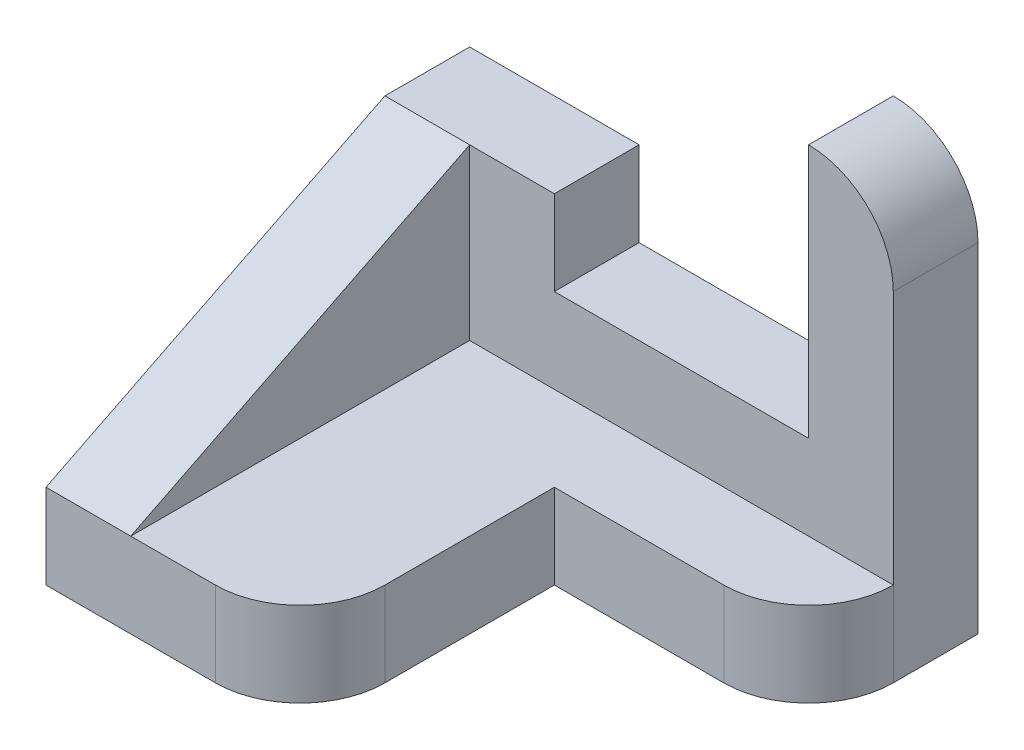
ISO-10303-21;
HEADER;
FILE_DESCRIPTION(('STEP AP214'),'2;1');
FILE_NAME('part.step','',(''),(''),'','','');
FILE_SCHEMA(('AUTOMOTIVE_DESIGN { 1 0 10303 214 1 1 1 1 }'));
ENDSEC;
DATA;
#1=APPLICATION_CONTEXT('core data for automotive mechanical design processes');
#2=APPLICATION_PROTOCOL_DEFINITION('international standard','automotive_design',2000,#1);
#3=PRODUCT_CONTEXT('',#1,'mechanical');
#4=PRODUCT('Part','Part','',(#3));
#5=PRODUCT_RELATED_PRODUCT_CATEGORY('part','',(#4));
#6=PRODUCT_DEFINITION_FORMATION('','',#4);
#7=PRODUCT_DEFINITION_CONTEXT('part definition',#1,'design');
#8=PRODUCT_DEFINITION('design','',#6,#7);
#9=PRODUCT_DEFINITION_SHAPE('','',#8);
#10=(LENGTH_UNIT() NAMED_UNIT(*) SI_UNIT(.MILLI.,.METRE.));
#11=(NAMED_UNIT(*) PLANE_ANGLE_UNIT() SI_UNIT($,.RADIAN.));
#12=(NAMED_UNIT(*) SI_UNIT($,.STERADIAN.) SOLID_ANGLE_UNIT());
#13=UNCERTAINTY_MEASURE_WITH_UNIT(LENGTH_MEASURE(1.E-05),#10,'distance_accuracy_value','');
#14=(GEOMETRIC_REPRESENTATION_CONTEXT(3) GLOBAL_UNCERTAINTY_ASSIGNED_CONTEXT((#13)) GLOBAL_UNIT_ASSIGNED_CONTEXT((#10,
#11,#12)) REPRESENTATION_CONTEXT('',''));
#15=CARTESIAN_POINT('',(0.,0.,0.));
#16=DIRECTION('',(0.,0.,1.));
#17=DIRECTION('',(1.,0.,0.));
#18=AXIS2_PLACEMENT_3D('',#15,#16,#17);
#19=CARTESIAN_POINT('',(0.,10.,0.));
#20=DIRECTION('',(0.,-1.,0.));
#21=DIRECTION('',(0.,0.,-1.));
#22=AXIS2_PLACEMENT_3D('',#19,#20,#21);
#23=PLANE('',#22);
#24=DIRECTION('',(1.,0.,0.));
#25=VECTOR('',#24,1.);
#26=CARTESIAN_POINT('',(60.,10.,20.));
#27=LINE('',#26,#25);
#28=CARTESIAN_POINT('',(30.,10.,20.));
#29=VERTEX_POINT('',#28);
#30=CARTESIAN_POINT('',(50.,10.,20.));
#31=VERTEX_POINT('',#30);
#32=EDGE_CURVE('E205',#29,#31,#27,.T.);
#33=ORIENTED_EDGE('',*,*,#32,.T.);
#34=CARTESIAN_POINT('',(50.,10.,10.));
#35=DIRECTION('',(0.,-1.,0.));
#36=DIRECTION('',(0.,0.,-1.));
#37=AXIS2_PLACEMENT_3D('',#34,#35,#36);
#38=CIRCLE('',#37,10.);
#39=CARTESIAN_POINT('',(60.,10.,10.));
#40=VERTEX_POINT('',#39);
#41=EDGE_CURVE('E262',#31,#40,#38,.F.);
#42=ORIENTED_EDGE('',*,*,#41,.T.);
#43=DIRECTION('',(-1.,0.,0.));
#44=VECTOR('',#43,1.);
#45=CARTESIAN_POINT('',(30.,10.,10.));
#46=LINE('',#45,#44);
#47=CARTESIAN_POINT('',(10.,10.,10.));
#48=VERTEX_POINT('',#47);
#49=EDGE_CURVE('E190',#40,#48,#46,.T.);
#50=ORIENTED_EDGE('',*,*,#49,.T.);
#51=DIRECTION('',(0.,0.,-1.));
#52=VECTOR('',#51,1.);
#53=CARTESIAN_POINT('',(10.,10.,0.));
#54=LINE('',#53,#52);
#55=CARTESIAN_POINT('',(10.,10.,50.));
#56=VERTEX_POINT('',#55);
#57=EDGE_CURVE('E142',#56,#48,#54,.T.);
#58=ORIENTED_EDGE('',*,*,#57,.F.);
#59=DIRECTION('',(1.,0.,0.));
#60=VECTOR('',#59,1.);
#61=CARTESIAN_POINT('',(30.,10.,50.));
#62=LINE('',#61,#60);
#63=CARTESIAN_POINT('',(20.,10.,50.));
#64=VERTEX_POINT('',#63);
#65=EDGE_CURVE('E203',#56,#64,#62,.T.);
#66=ORIENTED_EDGE('',*,*,#65,.T.);
#67=CARTESIAN_POINT('',(20.,10.,40.));
#68=DIRECTION('',(0.,-1.,0.));
#69=DIRECTION('',(0.,0.,-1.));
#70=AXIS2_PLACEMENT_3D('',#67,#68,#69);
#71=CIRCLE('',#70,10.);
#72=CARTESIAN_POINT('',(30.,10.,40.));
#73=VERTEX_POINT('',#72);
#74=EDGE_CURVE('E47',#64,#73,#71,.F.);
#75=ORIENTED_EDGE('',*,*,#74,.T.);
#76=DIRECTION('',(0.,0.,-1.));
#77=VECTOR('',#76,1.);
#78=CARTESIAN_POINT('',(30.,10.,20.));
#79=LINE('',#78,#77);
#80=EDGE_CURVE('E202',#73,#29,#79,.T.);
#81=ORIENTED_EDGE('',*,*,#80,.T.);
#82=EDGE_LOOP('',(#33,#42,#50,#58,#66,#75,#81));
#83=FACE_BOUND('',#82,.T.);
#84=ADVANCED_FACE('F32',(#83),#23,.F.);
#85=CARTESIAN_POINT('',(30.,-26.2306360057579,10.));
#86=DIRECTION('',(0.,0.,1.));
#87=DIRECTION('',(1.,0.,0.));
#88=AXIS2_PLACEMENT_3D('',#85,#86,#87);
#89=PLANE('',#88);
#90=DIRECTION('',(0.,-1.,0.));
#91=VECTOR('',#90,1.);
#92=CARTESIAN_POINT('',(60.,-26.2306360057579,10.));
#93=LINE('',#92,#91);
#94=CARTESIAN_POINT('',(60.,40.,10.));
#95=VERTEX_POINT('',#94);
#96=EDGE_CURVE('E234',#95,#40,#93,.T.);
#97=ORIENTED_EDGE('',*,*,#96,.F.);
#98=CARTESIAN_POINT('',(50.,40.,10.));
#99=DIRECTION('',(0.,0.,1.));
#100=DIRECTION('',(1.,0.,0.));
#101=AXIS2_PLACEMENT_3D('',#98,#99,#100);
#102=CIRCLE('',#101,10.);
#103=CARTESIAN_POINT('',(50.,50.,10.));
#104=VERTEX_POINT('',#103);
#105=EDGE_CURVE('E11',#95,#104,#102,.T.);
#106=ORIENTED_EDGE('',*,*,#105,.T.);
#107=DIRECTION('',(0.,1.,0.));
#108=VECTOR('',#107,1.);
#109=CARTESIAN_POINT('',(50.,-26.2306360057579,10.));
#110=LINE('',#109,#108);
#111=CARTESIAN_POINT('',(50.,20.,10.));
#112=VERTEX_POINT('',#111);
#113=EDGE_CURVE('E239',#112,#104,#110,.T.);
#114=ORIENTED_EDGE('',*,*,#113,.F.);
#115=DIRECTION('',(1.,0.,0.));
#116=VECTOR('',#115,1.);
#117=CARTESIAN_POINT('',(30.,20.,10.));
#118=LINE('',#117,#116);
#119=CARTESIAN_POINT('',(20.,20.,10.));
#120=VERTEX_POINT('',#119);
#121=EDGE_CURVE('E241',#120,#112,#118,.T.);
#122=ORIENTED_EDGE('',*,*,#121,.F.);
#123=DIRECTION('',(0.,-1.,0.));
#124=VECTOR('',#123,1.);
#125=CARTESIAN_POINT('',(20.,-26.2306360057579,10.));
#126=LINE('',#125,#124);
#127=CARTESIAN_POINT('',(20.,30.,10.));
#128=VERTEX_POINT('',#127);
#129=EDGE_CURVE('E165',#128,#120,#126,.T.);
#130=ORIENTED_EDGE('',*,*,#129,.F.);
#131=DIRECTION('',(1.,0.,0.));
#132=VECTOR('',#131,1.);
#133=CARTESIAN_POINT('',(30.,30.,10.));
#134=LINE('',#133,#132);
#135=CARTESIAN_POINT('',(10.,30.,10.));
#136=VERTEX_POINT('',#135);
#137=EDGE_CURVE('E160',#136,#128,#134,.T.);
#138=ORIENTED_EDGE('',*,*,#137,.F.);
#139=DIRECTION('',(0.,-1.,0.));
#140=VECTOR('',#139,1.);
#141=CARTESIAN_POINT('',(10.,-26.2306360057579,10.));
#142=LINE('',#141,#140);
#143=EDGE_CURVE('E137',#136,#48,#142,.T.);
#144=ORIENTED_EDGE('',*,*,#143,.T.);
#145=ORIENTED_EDGE('',*,*,#49,.F.);
#146=EDGE_LOOP('',(#97,#106,#114,#122,#130,#138,#144,#145));
#147=FACE_BOUND('',#146,.T.);
#148=ADVANCED_FACE('F162',(#147),#89,.T.);
#149=CARTESIAN_POINT('',(0.,10.,50.));
#150=DIRECTION('',(1.,0.,0.));
#151=DIRECTION('',(0.,0.,-1.));
#152=AXIS2_PLACEMENT_3D('',#149,#150,#151);
#153=PLANE('',#152);
#154=DIRECTION('',(0.,-1.,0.));
#155=VECTOR('',#154,1.);
#156=CARTESIAN_POINT('',(0.,10.,50.));
#157=LINE('',#156,#155);
#158=CARTESIAN_POINT('',(0.,10.,50.));
#159=VERTEX_POINT('',#158);
#160=CARTESIAN_POINT('',(0.,0.,50.));
#161=VERTEX_POINT('',#160);
#162=EDGE_CURVE('E148',#159,#161,#157,.T.);
#163=ORIENTED_EDGE('',*,*,#162,.F.);
#164=DIRECTION('',(0.,-0.447213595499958,0.894427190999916));
#165=VECTOR('',#164,1.);
#166=CARTESIAN_POINT('',(0.,30.,10.));
#167=LINE('',#166,#165);
#168=CARTESIAN_POINT('',(0.,30.,10.));
#169=VERTEX_POINT('',#168);
#170=EDGE_CURVE('E157',#169,#159,#167,.T.);
#171=ORIENTED_EDGE('',*,*,#170,.F.);
#172=DIRECTION('',(0.,0.,-1.));
#173=VECTOR('',#172,1.);
#174=CARTESIAN_POINT('',(0.,30.,10.));
#175=LINE('',#174,#173);
#176=CARTESIAN_POINT('',(0.,30.,0.));
#177=VERTEX_POINT('',#176);
#178=EDGE_CURVE('E174',#169,#177,#175,.T.);
#179=ORIENTED_EDGE('',*,*,#178,.T.);
#180=DIRECTION('',(0.,-1.,0.));
#181=VECTOR('',#180,1.);
#182=CARTESIAN_POINT('',(0.,10.,0.));
#183=LINE('',#182,#181);
#184=CARTESIAN_POINT('',(0.,0.,0.));
#185=VERTEX_POINT('',#184);
#186=EDGE_CURVE('E208',#177,#185,#183,.T.);
#187=ORIENTED_EDGE('',*,*,#186,.T.);
#188=DIRECTION('',(0.,0.,1.));
#189=VECTOR('',#188,1.);
#190=CARTESIAN_POINT('',(0.,0.,50.));
#191=LINE('',#190,#189);
#192=EDGE_CURVE('E200',#185,#161,#191,.T.);
#193=ORIENTED_EDGE('',*,*,#192,.T.);
#194=EDGE_LOOP('',(#163,#171,#179,#187,#193));
#195=FACE_BOUND('',#194,.T.);
#196=ADVANCED_FACE('F254',(#195),#153,.F.);
#197=CARTESIAN_POINT('',(30.,10.,50.));
#198=DIRECTION('',(0.,0.,-1.));
#199=DIRECTION('',(-1.,0.,0.));
#200=AXIS2_PLACEMENT_3D('',#197,#198,#199);
#201=PLANE('',#200);
#202=DIRECTION('',(1.,0.,0.));
#203=VECTOR('',#202,1.);
#204=CARTESIAN_POINT('',(30.,0.,50.));
#205=LINE('',#204,#203);
#206=CARTESIAN_POINT('',(20.,0.,50.));
#207=VERTEX_POINT('',#206);
#208=EDGE_CURVE('E211',#161,#207,#205,.T.);
#209=ORIENTED_EDGE('',*,*,#208,.T.);
#210=DIRECTION('',(0.,-1.,0.));
#211=VECTOR('',#210,1.);
#212=CARTESIAN_POINT('',(20.,10.,50.));
#213=LINE('',#212,#211);
#214=EDGE_CURVE('E55',#207,#64,#213,.F.);
#215=ORIENTED_EDGE('',*,*,#214,.T.);
#216=ORIENTED_EDGE('',*,*,#65,.F.);
#217=EDGE_CURVE('E156',#159,#56,#62,.T.);
#218=ORIENTED_EDGE('',*,*,#217,.F.);
#219=ORIENTED_EDGE('',*,*,#162,.T.);
#220=EDGE_LOOP('',(#209,#215,#216,#218,#219));
#221=FACE_BOUND('',#220,.T.);
#222=ADVANCED_FACE('F256',(#221),#201,.F.);
#223=CARTESIAN_POINT('',(30.,10.,20.));
#224=DIRECTION('',(-1.,0.,0.));
#225=DIRECTION('',(0.,0.,1.));
#226=AXIS2_PLACEMENT_3D('',#223,#224,#225);
#227=PLANE('',#226);
#228=ORIENTED_EDGE('',*,*,#80,.F.);
#229=DIRECTION('',(0.,-1.,0.));
#230=VECTOR('',#229,1.);
#231=CARTESIAN_POINT('',(30.,10.,40.));
#232=LINE('',#231,#230);
#233=CARTESIAN_POINT('',(30.,0.,40.));
#234=VERTEX_POINT('',#233);
#235=EDGE_CURVE('E261',#73,#234,#232,.T.);
#236=ORIENTED_EDGE('',*,*,#235,.T.);
#237=DIRECTION('',(0.,0.,-1.));
#238=VECTOR('',#237,1.);
#239=CARTESIAN_POINT('',(30.,0.,20.));
#240=LINE('',#239,#238);
#241=CARTESIAN_POINT('',(30.,0.,20.));
#242=VERTEX_POINT('',#241);
#243=EDGE_CURVE('E213',#234,#242,#240,.T.);
#244=ORIENTED_EDGE('',*,*,#243,.T.);
#245=DIRECTION('',(0.,-1.,0.));
#246=VECTOR('',#245,1.);
#247=CARTESIAN_POINT('',(30.,10.,20.));
#248=LINE('',#247,#246);
#249=EDGE_CURVE('E227',#29,#242,#248,.T.);
#250=ORIENTED_EDGE('',*,*,#249,.F.);
#251=EDGE_LOOP('',(#228,#236,#244,#250));
#252=FACE_BOUND('',#251,.T.);
#253=ADVANCED_FACE('F332',(#252),#227,.F.);
#254=CARTESIAN_POINT('',(60.,10.,20.));
#255=DIRECTION('',(0.,0.,-1.));
#256=DIRECTION('',(-1.,0.,0.));
#257=AXIS2_PLACEMENT_3D('',#254,#255,#256);
#258=PLANE('',#257);
#259=DIRECTION('',(1.,0.,0.));
#260=VECTOR('',#259,1.);
#261=CARTESIAN_POINT('',(60.,0.,20.));
#262=LINE('',#261,#260);
#263=CARTESIAN_POINT('',(50.,0.,20.));
#264=VERTEX_POINT('',#263);
#265=EDGE_CURVE('E215',#242,#264,#262,.T.);
#266=ORIENTED_EDGE('',*,*,#265,.T.);
#267=DIRECTION('',(0.,-1.,0.));
#268=VECTOR('',#267,1.);
#269=CARTESIAN_POINT('',(50.,10.,20.));
#270=LINE('',#269,#268);
#271=EDGE_CURVE('E263',#264,#31,#270,.F.);
#272=ORIENTED_EDGE('',*,*,#271,.T.);
#273=ORIENTED_EDGE('',*,*,#32,.F.);
#274=ORIENTED_EDGE('',*,*,#249,.T.);
#275=EDGE_LOOP('',(#266,#272,#273,#274));
#276=FACE_BOUND('',#275,.T.);
#277=ADVANCED_FACE('F300',(#276),#258,.F.);
#278=CARTESIAN_POINT('',(60.,10.,0.));
#279=DIRECTION('',(-1.,0.,0.));
#280=DIRECTION('',(0.,0.,1.));
#281=AXIS2_PLACEMENT_3D('',#278,#279,#280);
#282=PLANE('',#281);
#283=ORIENTED_EDGE('',*,*,#96,.T.);
#284=DIRECTION('',(0.,-1.,0.));
#285=VECTOR('',#284,1.);
#286=CARTESIAN_POINT('',(60.,10.,10.));
#287=LINE('',#286,#285);
#288=CARTESIAN_POINT('',(60.,0.,10.));
#289=VERTEX_POINT('',#288);
#290=EDGE_CURVE('E284',#40,#289,#287,.T.);
#291=ORIENTED_EDGE('',*,*,#290,.T.);
#292=DIRECTION('',(0.,0.,-1.));
#293=VECTOR('',#292,1.);
#294=CARTESIAN_POINT('',(60.,0.,0.));
#295=LINE('',#294,#293);
#296=CARTESIAN_POINT('',(60.,0.,0.));
#297=VERTEX_POINT('',#296);
#298=EDGE_CURVE('E218',#289,#297,#295,.T.);
#299=ORIENTED_EDGE('',*,*,#298,.T.);
#300=DIRECTION('',(0.,-1.,0.));
#301=VECTOR('',#300,1.);
#302=CARTESIAN_POINT('',(60.,10.,0.));
#303=LINE('',#302,#301);
#304=CARTESIAN_POINT('',(60.,40.,0.));
#305=VERTEX_POINT('',#304);
#306=EDGE_CURVE('E225',#305,#297,#303,.T.);
#307=ORIENTED_EDGE('',*,*,#306,.F.);
#308=DIRECTION('',(0.,0.,-1.));
#309=VECTOR('',#308,1.);
#310=CARTESIAN_POINT('',(60.,40.,10.));
#311=LINE('',#310,#309);
#312=EDGE_CURVE('E147',#305,#95,#311,.F.);
#313=ORIENTED_EDGE('',*,*,#312,.T.);
#314=EDGE_LOOP('',(#283,#291,#299,#307,#313));
#315=FACE_BOUND('',#314,.T.);
#316=ADVANCED_FACE('F280',(#315),#282,.F.);
#317=CARTESIAN_POINT('',(0.,10.,0.));
#318=DIRECTION('',(0.,0.,1.));
#319=DIRECTION('',(1.,0.,0.));
#320=AXIS2_PLACEMENT_3D('',#317,#318,#319);
#321=PLANE('',#320);
#322=DIRECTION('',(0.,1.,0.));
#323=VECTOR('',#322,1.);
#324=CARTESIAN_POINT('',(50.,-26.2306360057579,0.));
#325=LINE('',#324,#323);
#326=CARTESIAN_POINT('',(50.,20.,0.));
#327=VERTEX_POINT('',#326);
#328=CARTESIAN_POINT('',(50.,50.,0.));
#329=VERTEX_POINT('',#328);
#330=EDGE_CURVE('E180',#327,#329,#325,.T.);
#331=ORIENTED_EDGE('',*,*,#330,.T.);
#332=CARTESIAN_POINT('',(50.,40.,0.));
#333=DIRECTION('',(0.,0.,1.));
#334=DIRECTION('',(1.,0.,0.));
#335=AXIS2_PLACEMENT_3D('',#332,#333,#334);
#336=CIRCLE('',#335,10.);
#337=EDGE_CURVE('E40',#329,#305,#336,.F.);
#338=ORIENTED_EDGE('',*,*,#337,.T.);
#339=ORIENTED_EDGE('',*,*,#306,.T.);
#340=DIRECTION('',(-1.,0.,0.));
#341=VECTOR('',#340,1.);
#342=CARTESIAN_POINT('',(0.,0.,0.));
#343=LINE('',#342,#341);
#344=EDGE_CURVE('E221',#297,#185,#343,.T.);
#345=ORIENTED_EDGE('',*,*,#344,.T.);
#346=ORIENTED_EDGE('',*,*,#186,.F.);
#347=DIRECTION('',(1.,0.,0.));
#348=VECTOR('',#347,1.);
#349=CARTESIAN_POINT('',(30.,30.,0.));
#350=LINE('',#349,#348);
#351=CARTESIAN_POINT('',(20.,30.,0.));
#352=VERTEX_POINT('',#351);
#353=EDGE_CURVE('E189',#177,#352,#350,.T.);
#354=ORIENTED_EDGE('',*,*,#353,.T.);
#355=DIRECTION('',(0.,-1.,0.));
#356=VECTOR('',#355,1.);
#357=CARTESIAN_POINT('',(20.,-26.2306360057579,0.));
#358=LINE('',#357,#356);
#359=CARTESIAN_POINT('',(20.,20.,0.));
#360=VERTEX_POINT('',#359);
#361=EDGE_CURVE('E186',#352,#360,#358,.T.);
#362=ORIENTED_EDGE('',*,*,#361,.T.);
#363=DIRECTION('',(1.,0.,0.));
#364=VECTOR('',#363,1.);
#365=CARTESIAN_POINT('',(30.,20.,0.));
#366=LINE('',#365,#364);
#367=EDGE_CURVE('E183',#360,#327,#366,.T.);
#368=ORIENTED_EDGE('',*,*,#367,.T.);
#369=EDGE_LOOP('',(#331,#338,#339,#345,#346,#354,#362,#368));
#370=FACE_BOUND('',#369,.T.);
#371=ADVANCED_FACE('F249',(#370),#321,.F.);
#372=CARTESIAN_POINT('',(0.,0.,0.));
#373=DIRECTION('',(0.,-1.,0.));
#374=DIRECTION('',(0.,0.,-1.));
#375=AXIS2_PLACEMENT_3D('',#372,#373,#374);
#376=PLANE('',#375);
#377=ORIENTED_EDGE('',*,*,#298,.F.);
#378=CARTESIAN_POINT('',(50.,0.,10.));
#379=DIRECTION('',(0.,-1.,0.));
#380=DIRECTION('',(0.,0.,-1.));
#381=AXIS2_PLACEMENT_3D('',#378,#379,#380);
#382=CIRCLE('',#381,10.);
#383=EDGE_CURVE('E266',#289,#264,#382,.T.);
#384=ORIENTED_EDGE('',*,*,#383,.T.);
#385=ORIENTED_EDGE('',*,*,#265,.F.);
#386=ORIENTED_EDGE('',*,*,#243,.F.);
#387=CARTESIAN_POINT('',(20.,0.,40.));
#388=DIRECTION('',(0.,-1.,0.));
#389=DIRECTION('',(0.,0.,-1.));
#390=AXIS2_PLACEMENT_3D('',#387,#388,#389);
#391=CIRCLE('',#390,10.);
#392=EDGE_CURVE('E286',#234,#207,#391,.T.);
#393=ORIENTED_EDGE('',*,*,#392,.T.);
#394=ORIENTED_EDGE('',*,*,#208,.F.);
#395=ORIENTED_EDGE('',*,*,#192,.F.);
#396=ORIENTED_EDGE('',*,*,#344,.F.);
#397=EDGE_LOOP('',(#377,#384,#385,#386,#393,#394,#395,#396));
#398=FACE_BOUND('',#397,.T.);
#399=ADVANCED_FACE('F294',(#398),#376,.T.);
#400=CARTESIAN_POINT('',(50.,-26.2306360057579,10.));
#401=DIRECTION('',(-1.,0.,0.));
#402=DIRECTION('',(0.,0.,1.));
#403=AXIS2_PLACEMENT_3D('',#400,#401,#402);
#404=PLANE('',#403);
#405=ORIENTED_EDGE('',*,*,#330,.F.);
#406=DIRECTION('',(0.,0.,-1.));
#407=VECTOR('',#406,1.);
#408=CARTESIAN_POINT('',(50.,20.,10.));
#409=LINE('',#408,#407);
#410=EDGE_CURVE('E195',#112,#327,#409,.T.);
#411=ORIENTED_EDGE('',*,*,#410,.F.);
#412=ORIENTED_EDGE('',*,*,#113,.T.);
#413=DIRECTION('',(0.,0.,-1.));
#414=VECTOR('',#413,1.);
#415=CARTESIAN_POINT('',(50.,50.,10.));
#416=LINE('',#415,#414);
#417=EDGE_CURVE('E197',#104,#329,#416,.T.);
#418=ORIENTED_EDGE('',*,*,#417,.T.);
#419=EDGE_LOOP('',(#405,#411,#412,#418));
#420=FACE_BOUND('',#419,.T.);
#421=ADVANCED_FACE('F307',(#420),#404,.T.);
#422=CARTESIAN_POINT('',(30.,20.,10.));
#423=DIRECTION('',(0.,1.,0.));
#424=DIRECTION('',(-1.,0.,0.));
#425=AXIS2_PLACEMENT_3D('',#422,#423,#424);
#426=PLANE('',#425);
#427=ORIENTED_EDGE('',*,*,#367,.F.);
#428=DIRECTION('',(0.,0.,-1.));
#429=VECTOR('',#428,1.);
#430=CARTESIAN_POINT('',(20.,20.,10.));
#431=LINE('',#430,#429);
#432=EDGE_CURVE('E193',#120,#360,#431,.T.);
#433=ORIENTED_EDGE('',*,*,#432,.F.);
#434=ORIENTED_EDGE('',*,*,#121,.T.);
#435=ORIENTED_EDGE('',*,*,#410,.T.);
#436=EDGE_LOOP('',(#427,#433,#434,#435));
#437=FACE_BOUND('',#436,.T.);
#438=ADVANCED_FACE('F308',(#437),#426,.T.);
#439=CARTESIAN_POINT('',(20.,-26.2306360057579,10.));
#440=DIRECTION('',(1.,0.,0.));
#441=DIRECTION('',(0.,0.,-1.));
#442=AXIS2_PLACEMENT_3D('',#439,#440,#441);
#443=PLANE('',#442);
#444=ORIENTED_EDGE('',*,*,#361,.F.);
#445=DIRECTION('',(0.,0.,-1.));
#446=VECTOR('',#445,1.);
#447=CARTESIAN_POINT('',(20.,30.,10.));
#448=LINE('',#447,#446);
#449=EDGE_CURVE('E175',#128,#352,#448,.T.);
#450=ORIENTED_EDGE('',*,*,#449,.F.);
#451=ORIENTED_EDGE('',*,*,#129,.T.);
#452=ORIENTED_EDGE('',*,*,#432,.T.);
#453=EDGE_LOOP('',(#444,#450,#451,#452));
#454=FACE_BOUND('',#453,.T.);
#455=ADVANCED_FACE('F246',(#454),#443,.T.);
#456=CARTESIAN_POINT('',(30.,30.,10.));
#457=DIRECTION('',(0.,1.,0.));
#458=DIRECTION('',(0.,0.,1.));
#459=AXIS2_PLACEMENT_3D('',#456,#457,#458);
#460=PLANE('',#459);
#461=EDGE_CURVE('E153',#169,#136,#134,.T.);
#462=ORIENTED_EDGE('',*,*,#461,.T.);
#463=ORIENTED_EDGE('',*,*,#137,.T.);
#464=ORIENTED_EDGE('',*,*,#449,.T.);
#465=ORIENTED_EDGE('',*,*,#353,.F.);
#466=ORIENTED_EDGE('',*,*,#178,.F.);
#467=EDGE_LOOP('',(#462,#463,#464,#465,#466));
#468=FACE_BOUND('',#467,.T.);
#469=ADVANCED_FACE('F171',(#468),#460,.T.);
#470=CARTESIAN_POINT('',(0.,30.,10.));
#471=DIRECTION('',(0.,-0.894427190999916,-0.447213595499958));
#472=DIRECTION('',(0.,-0.447213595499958,0.894427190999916));
#473=AXIS2_PLACEMENT_3D('',#470,#471,#472);
#474=PLANE('',#473);
#475=ORIENTED_EDGE('',*,*,#217,.T.);
#476=DIRECTION('',(0.,-0.447213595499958,0.894427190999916));
#477=VECTOR('',#476,1.);
#478=CARTESIAN_POINT('',(10.,30.,10.));
#479=LINE('',#478,#477);
#480=EDGE_CURVE('E140',#136,#56,#479,.T.);
#481=ORIENTED_EDGE('',*,*,#480,.F.);
#482=ORIENTED_EDGE('',*,*,#461,.F.);
#483=ORIENTED_EDGE('',*,*,#170,.T.);
#484=EDGE_LOOP('',(#475,#481,#482,#483));
#485=FACE_BOUND('',#484,.T.);
#486=ADVANCED_FACE('F151',(#485),#474,.F.);
#487=CARTESIAN_POINT('',(10.,25.0000125,25.0000125));
#488=DIRECTION('',(-1.,0.,0.));
#489=DIRECTION('',(0.,0.,1.));
#490=AXIS2_PLACEMENT_3D('',#487,#488,#489);
#491=PLANE('',#490);
#492=ORIENTED_EDGE('',*,*,#480,.T.);
#493=ORIENTED_EDGE('',*,*,#57,.T.);
#494=ORIENTED_EDGE('',*,*,#143,.F.);
#495=EDGE_LOOP('',(#492,#493,#494));
#496=FACE_BOUND('',#495,.T.);
#497=ADVANCED_FACE('F139',(#496),#491,.F.);
#498=CARTESIAN_POINT('',(50.,10.,10.));
#499=DIRECTION('',(0.,-1.,0.));
#500=DIRECTION('',(0.,0.,-1.));
#501=AXIS2_PLACEMENT_3D('',#498,#499,#500);
#502=CYLINDRICAL_SURFACE('',#501,10.);
#503=ORIENTED_EDGE('',*,*,#41,.F.);
#504=ORIENTED_EDGE('',*,*,#271,.F.);
#505=ORIENTED_EDGE('',*,*,#383,.F.);
#506=ORIENTED_EDGE('',*,*,#290,.F.);
#507=EDGE_LOOP('',(#503,#504,#505,#506));
#508=FACE_BOUND('',#507,.T.);
#509=ADVANCED_FACE('F304',(#508),#502,.T.);
#510=CARTESIAN_POINT('',(20.,10.,40.));
#511=DIRECTION('',(0.,-1.,0.));
#512=DIRECTION('',(0.,0.,-1.));
#513=AXIS2_PLACEMENT_3D('',#510,#511,#512);
#514=CYLINDRICAL_SURFACE('',#513,10.);
#515=ORIENTED_EDGE('',*,*,#74,.F.);
#516=ORIENTED_EDGE('',*,*,#214,.F.);
#517=ORIENTED_EDGE('',*,*,#392,.F.);
#518=ORIENTED_EDGE('',*,*,#235,.F.);
#519=EDGE_LOOP('',(#515,#516,#517,#518));
#520=FACE_BOUND('',#519,.T.);
#521=ADVANCED_FACE('F259',(#520),#514,.T.);
#522=CARTESIAN_POINT('',(50.,40.,10.));
#523=DIRECTION('',(0.,0.,1.));
#524=DIRECTION('',(1.,0.,0.));
#525=AXIS2_PLACEMENT_3D('',#522,#523,#524);
#526=CYLINDRICAL_SURFACE('',#525,10.);
#527=ORIENTED_EDGE('',*,*,#105,.F.);
#528=ORIENTED_EDGE('',*,*,#312,.F.);
#529=ORIENTED_EDGE('',*,*,#337,.F.);
#530=ORIENTED_EDGE('',*,*,#417,.F.);
#531=EDGE_LOOP('',(#527,#528,#529,#530));
#532=FACE_BOUND('',#531,.T.);
#533=ADVANCED_FACE('F34',(#532),#526,.T.);
#534=CLOSED_SHELL('',(#84,#148,#196,#222,#253,#277,#316,#371,#399,#421,#438,#455,#469,#486,#497,
#509,#521,#533));
#535=MANIFOLD_SOLID_BREP('B2',#534);
#536=ADVANCED_BREP_SHAPE_REPRESENTATION('',(#18,#535),#14);
#537=SHAPE_DEFINITION_REPRESENTATION(#9,#536);
ENDSEC;
END-ISO-10303-21;
